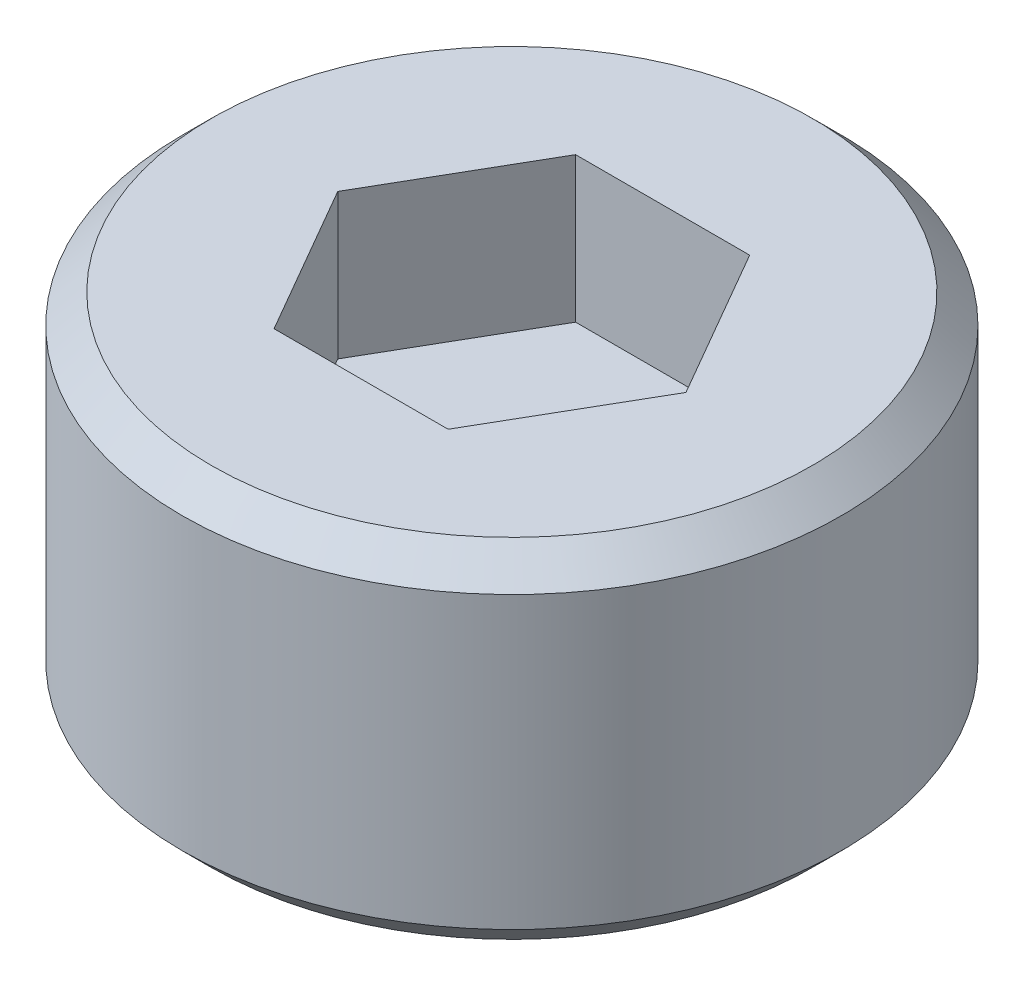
ISO-10303-21;
HEADER;
FILE_DESCRIPTION(('STEP AP214'),'2;1');
FILE_NAME('part.step','',(''),(''),'','','');
FILE_SCHEMA(('AUTOMOTIVE_DESIGN { 1 0 10303 214 1 1 1 1 }'));
ENDSEC;
DATA;
#1=APPLICATION_CONTEXT('core data for automotive mechanical design processes');
#2=APPLICATION_PROTOCOL_DEFINITION('international standard','automotive_design',2000,#1);
#3=PRODUCT_CONTEXT('',#1,'mechanical');
#4=PRODUCT('Part','Part','',(#3));
#5=PRODUCT_RELATED_PRODUCT_CATEGORY('part','',(#4));
#6=PRODUCT_DEFINITION_FORMATION('','',#4);
#7=PRODUCT_DEFINITION_CONTEXT('part definition',#1,'design');
#8=PRODUCT_DEFINITION('design','',#6,#7);
#9=PRODUCT_DEFINITION_SHAPE('','',#8);
#10=(LENGTH_UNIT() NAMED_UNIT(*) SI_UNIT(.MILLI.,.METRE.));
#11=(NAMED_UNIT(*) PLANE_ANGLE_UNIT() SI_UNIT($,.RADIAN.));
#12=(NAMED_UNIT(*) SI_UNIT($,.STERADIAN.) SOLID_ANGLE_UNIT());
#13=UNCERTAINTY_MEASURE_WITH_UNIT(LENGTH_MEASURE(1.E-05),#10,'distance_accuracy_value','');
#14=(GEOMETRIC_REPRESENTATION_CONTEXT(3) GLOBAL_UNCERTAINTY_ASSIGNED_CONTEXT((#13)) GLOBAL_UNIT_ASSIGNED_CONTEXT((#10,
#11,#12)) REPRESENTATION_CONTEXT('',''));
#15=CARTESIAN_POINT('',(0.,0.,0.));
#16=DIRECTION('',(0.,0.,1.));
#17=DIRECTION('',(1.,0.,0.));
#18=AXIS2_PLACEMENT_3D('',#15,#16,#17);
#19=CARTESIAN_POINT('',(0.,1.75,0.));
#20=DIRECTION('',(0.,1.,0.));
#21=DIRECTION('',(1.,0.,0.));
#22=AXIS2_PLACEMENT_3D('',#19,#20,#21);
#23=PLANE('',#22);
#24=DIRECTION('',(-0.500000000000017,0.,-0.866025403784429));
#25=VECTOR('',#24,1.);
#26=CARTESIAN_POINT('',(-0.7499999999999,1.75,1.299038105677));
#27=LINE('',#26,#25);
#28=CARTESIAN_POINT('',(-0.7499999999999,1.75,1.299038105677));
#29=VERTEX_POINT('',#28);
#30=CARTESIAN_POINT('',(-1.5,1.75,0.));
#31=VERTEX_POINT('',#30);
#32=EDGE_CURVE('E167',#29,#31,#27,.T.);
#33=ORIENTED_EDGE('',*,*,#32,.F.);
#34=DIRECTION('',(1.,0.,0.));
#35=VECTOR('',#34,1.);
#36=CARTESIAN_POINT('',(-0.7499999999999,1.75,1.299038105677));
#37=LINE('',#36,#35);
#38=CARTESIAN_POINT('',(0.75,1.75,1.299038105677));
#39=VERTEX_POINT('',#38);
#40=EDGE_CURVE('E11',#29,#39,#37,.T.);
#41=ORIENTED_EDGE('',*,*,#40,.T.);
#42=DIRECTION('',(-0.499999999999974,0.,0.866025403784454));
#43=VECTOR('',#42,1.);
#44=CARTESIAN_POINT('',(1.5,1.75,0.));
#45=LINE('',#44,#43);
#46=CARTESIAN_POINT('',(1.5,1.75,0.));
#47=VERTEX_POINT('',#46);
#48=EDGE_CURVE('E42',#47,#39,#45,.T.);
#49=ORIENTED_EDGE('',*,*,#48,.F.);
#50=DIRECTION('',(0.500000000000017,0.,0.866025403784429));
#51=VECTOR('',#50,1.);
#52=CARTESIAN_POINT('',(0.7499999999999,1.75,-1.299038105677));
#53=LINE('',#52,#51);
#54=CARTESIAN_POINT('',(0.7499999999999,1.75,-1.299038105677));
#55=VERTEX_POINT('',#54);
#56=EDGE_CURVE('E198',#55,#47,#53,.T.);
#57=ORIENTED_EDGE('',*,*,#56,.F.);
#58=DIRECTION('',(-1.,0.,0.));
#59=VECTOR('',#58,1.);
#60=CARTESIAN_POINT('',(0.7499999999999,1.75,-1.299038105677));
#61=LINE('',#60,#59);
#62=CARTESIAN_POINT('',(-0.75,1.75,-1.299038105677));
#63=VERTEX_POINT('',#62);
#64=EDGE_CURVE('E193',#55,#63,#61,.T.);
#65=ORIENTED_EDGE('',*,*,#64,.T.);
#66=DIRECTION('',(0.499999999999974,0.,-0.866025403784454));
#67=VECTOR('',#66,1.);
#68=CARTESIAN_POINT('',(-1.5,1.75,0.));
#69=LINE('',#68,#67);
#70=EDGE_CURVE('E185',#31,#63,#69,.T.);
#71=ORIENTED_EDGE('',*,*,#70,.F.);
#72=EDGE_LOOP('',(#33,#41,#49,#57,#65,#71));
#73=FACE_BOUND('',#72,.T.);
#74=ADVANCED_FACE('F17',(#73),#23,.T.);
#75=CARTESIAN_POINT('',(-0.75,3.,1.299038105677));
#76=DIRECTION('',(0.,0.,1.));
#77=DIRECTION('',(1.,0.,0.));
#78=AXIS2_PLACEMENT_3D('',#75,#76,#77);
#79=PLANE('',#78);
#80=DIRECTION('',(1.,0.,0.));
#81=VECTOR('',#80,1.);
#82=CARTESIAN_POINT('',(-0.7499999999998,3.,1.299038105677));
#83=LINE('',#82,#81);
#84=CARTESIAN_POINT('',(-0.7499999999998,3.,1.299038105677));
#85=VERTEX_POINT('',#84);
#86=CARTESIAN_POINT('',(0.75,3.,1.299038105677));
#87=VERTEX_POINT('',#86);
#88=EDGE_CURVE('E163',#85,#87,#83,.T.);
#89=ORIENTED_EDGE('',*,*,#88,.T.);
#90=DIRECTION('',(0.,-1.,0.));
#91=VECTOR('',#90,1.);
#92=CARTESIAN_POINT('',(0.75,3.,1.299038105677));
#93=LINE('',#92,#91);
#94=EDGE_CURVE('E25',#87,#39,#93,.T.);
#95=ORIENTED_EDGE('',*,*,#94,.T.);
#96=ORIENTED_EDGE('',*,*,#40,.F.);
#97=DIRECTION('',(0.,-1.,0.));
#98=VECTOR('',#97,1.);
#99=CARTESIAN_POINT('',(-0.7499999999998,3.,1.299038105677));
#100=LINE('',#99,#98);
#101=EDGE_CURVE('E172',#85,#29,#100,.T.);
#102=ORIENTED_EDGE('',*,*,#101,.F.);
#103=EDGE_LOOP('',(#89,#95,#96,#102));
#104=FACE_BOUND('',#103,.T.);
#105=ADVANCED_FACE('F213',(#104),#79,.F.);
#106=CARTESIAN_POINT('',(0.75,3.,1.299038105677));
#107=DIRECTION('',(0.866025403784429,0.,0.500000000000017));
#108=DIRECTION('',(0.,-1.,0.));
#109=AXIS2_PLACEMENT_3D('',#106,#107,#108);
#110=PLANE('',#109);
#111=DIRECTION('',(0.499999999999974,0.,-0.866025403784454));
#112=VECTOR('',#111,1.);
#113=CARTESIAN_POINT('',(0.75,3.,1.299038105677));
#114=LINE('',#113,#112);
#115=CARTESIAN_POINT('',(1.5,3.,1.416644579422E-13));
#116=VERTEX_POINT('',#115);
#117=EDGE_CURVE('E145',#87,#116,#114,.T.);
#118=ORIENTED_EDGE('',*,*,#117,.T.);
#119=DIRECTION('',(0.,-1.,0.));
#120=VECTOR('',#119,1.);
#121=CARTESIAN_POINT('',(1.5,3.,1.416526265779E-13));
#122=LINE('',#121,#120);
#123=EDGE_CURVE('E204',#116,#47,#122,.T.);
#124=ORIENTED_EDGE('',*,*,#123,.T.);
#125=ORIENTED_EDGE('',*,*,#48,.T.);
#126=ORIENTED_EDGE('',*,*,#94,.F.);
#127=EDGE_LOOP('',(#118,#124,#125,#126));
#128=FACE_BOUND('',#127,.T.);
#129=ADVANCED_FACE('F217',(#128),#110,.F.);
#130=CARTESIAN_POINT('',(1.5,3.,0.));
#131=DIRECTION('',(0.866025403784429,0.,-0.500000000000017));
#132=DIRECTION('',(0.,-1.,0.));
#133=AXIS2_PLACEMENT_3D('',#130,#131,#132);
#134=PLANE('',#133);
#135=DIRECTION('',(-0.500000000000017,0.,-0.866025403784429));
#136=VECTOR('',#135,1.);
#137=CARTESIAN_POINT('',(1.5,3.,1.416526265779E-13));
#138=LINE('',#137,#136);
#139=CARTESIAN_POINT('',(0.7499999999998,3.,-1.299038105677));
#140=VERTEX_POINT('',#139);
#141=EDGE_CURVE('E141',#116,#140,#138,.T.);
#142=ORIENTED_EDGE('',*,*,#141,.T.);
#143=DIRECTION('',(0.,-1.,0.));
#144=VECTOR('',#143,1.);
#145=CARTESIAN_POINT('',(0.7499999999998,3.,-1.299038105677));
#146=LINE('',#145,#144);
#147=EDGE_CURVE('E194',#140,#55,#146,.T.);
#148=ORIENTED_EDGE('',*,*,#147,.T.);
#149=ORIENTED_EDGE('',*,*,#56,.T.);
#150=ORIENTED_EDGE('',*,*,#123,.F.);
#151=EDGE_LOOP('',(#142,#148,#149,#150));
#152=FACE_BOUND('',#151,.T.);
#153=ADVANCED_FACE('F220',(#152),#134,.F.);
#154=CARTESIAN_POINT('',(0.75,3.,-1.299038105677));
#155=DIRECTION('',(0.,0.,-1.));
#156=DIRECTION('',(0.,-1.,0.));
#157=AXIS2_PLACEMENT_3D('',#154,#155,#156);
#158=PLANE('',#157);
#159=DIRECTION('',(-1.,0.,0.));
#160=VECTOR('',#159,1.);
#161=CARTESIAN_POINT('',(0.7499999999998,3.,-1.299038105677));
#162=LINE('',#161,#160);
#163=CARTESIAN_POINT('',(-0.75,3.,-1.299038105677));
#164=VERTEX_POINT('',#163);
#165=EDGE_CURVE('E146',#140,#164,#162,.T.);
#166=ORIENTED_EDGE('',*,*,#165,.T.);
#167=DIRECTION('',(0.,-1.,0.));
#168=VECTOR('',#167,1.);
#169=CARTESIAN_POINT('',(-0.75,3.,-1.299038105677));
#170=LINE('',#169,#168);
#171=EDGE_CURVE('E189',#164,#63,#170,.T.);
#172=ORIENTED_EDGE('',*,*,#171,.T.);
#173=ORIENTED_EDGE('',*,*,#64,.F.);
#174=ORIENTED_EDGE('',*,*,#147,.F.);
#175=EDGE_LOOP('',(#166,#172,#173,#174));
#176=FACE_BOUND('',#175,.T.);
#177=ADVANCED_FACE('F223',(#176),#158,.F.);
#178=CARTESIAN_POINT('',(-0.75,3.,-1.299038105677));
#179=DIRECTION('',(-0.866025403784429,0.,-0.500000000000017));
#180=DIRECTION('',(-0.500000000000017,0.,0.866025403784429));
#181=AXIS2_PLACEMENT_3D('',#178,#179,#180);
#182=PLANE('',#181);
#183=DIRECTION('',(-0.499999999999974,0.,0.866025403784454));
#184=VECTOR('',#183,1.);
#185=CARTESIAN_POINT('',(-0.75,3.,-1.299038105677));
#186=LINE('',#185,#184);
#187=CARTESIAN_POINT('',(-1.5,3.,-1.416526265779E-13));
#188=VERTEX_POINT('',#187);
#189=EDGE_CURVE('E152',#164,#188,#186,.T.);
#190=ORIENTED_EDGE('',*,*,#189,.T.);
#191=DIRECTION('',(0.,-1.,0.));
#192=VECTOR('',#191,1.);
#193=CARTESIAN_POINT('',(-1.5,3.,-1.416526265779E-13));
#194=LINE('',#193,#192);
#195=EDGE_CURVE('E171',#188,#31,#194,.T.);
#196=ORIENTED_EDGE('',*,*,#195,.T.);
#197=ORIENTED_EDGE('',*,*,#70,.T.);
#198=ORIENTED_EDGE('',*,*,#171,.F.);
#199=EDGE_LOOP('',(#190,#196,#197,#198));
#200=FACE_BOUND('',#199,.T.);
#201=ADVANCED_FACE('F227',(#200),#182,.F.);
#202=CARTESIAN_POINT('',(-1.5,3.,0.));
#203=DIRECTION('',(-0.866025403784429,0.,0.500000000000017));
#204=DIRECTION('',(0.,1.,0.));
#205=AXIS2_PLACEMENT_3D('',#202,#203,#204);
#206=PLANE('',#205);
#207=DIRECTION('',(0.500000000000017,0.,0.866025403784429));
#208=VECTOR('',#207,1.);
#209=CARTESIAN_POINT('',(-1.5,3.,-1.416526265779E-13));
#210=LINE('',#209,#208);
#211=EDGE_CURVE('E149',#188,#85,#210,.T.);
#212=ORIENTED_EDGE('',*,*,#211,.T.);
#213=ORIENTED_EDGE('',*,*,#101,.T.);
#214=ORIENTED_EDGE('',*,*,#32,.T.);
#215=ORIENTED_EDGE('',*,*,#195,.F.);
#216=EDGE_LOOP('',(#212,#213,#214,#215));
#217=FACE_BOUND('',#216,.T.);
#218=ADVANCED_FACE('F230',(#217),#206,.F.);
#219=CARTESIAN_POINT('',(0.,3.,0.));
#220=DIRECTION('',(0.,1.,0.));
#221=DIRECTION('',(1.,0.,0.));
#222=AXIS2_PLACEMENT_3D('',#219,#220,#221);
#223=PLANE('',#222);
#224=ORIENTED_EDGE('',*,*,#211,.F.);
#225=ORIENTED_EDGE('',*,*,#189,.F.);
#226=ORIENTED_EDGE('',*,*,#165,.F.);
#227=ORIENTED_EDGE('',*,*,#141,.F.);
#228=ORIENTED_EDGE('',*,*,#117,.F.);
#229=ORIENTED_EDGE('',*,*,#88,.F.);
#230=EDGE_LOOP('',(#224,#225,#226,#227,#228,#229));
#231=FACE_BOUND('',#230,.T.);
#232=CARTESIAN_POINT('',(0.,3.,0.));
#233=DIRECTION('',(0.,-1.,0.));
#234=DIRECTION('',(1.,0.,0.));
#235=AXIS2_PLACEMENT_3D('',#232,#233,#234);
#236=CIRCLE('',#235,2.59);
#237=CARTESIAN_POINT('',(0.,3.,2.59));
#238=VERTEX_POINT('',#237);
#239=EDGE_CURVE('E147',#238,#238,#236,.T.);
#240=ORIENTED_EDGE('',*,*,#239,.F.);
#241=EDGE_LOOP('',(#240));
#242=FACE_BOUND('',#241,.T.);
#243=ADVANCED_FACE('F232',(#231,#242),#223,.T.);
#244=CARTESIAN_POINT('',(0.,2.875,0.));
#245=DIRECTION('',(0.,-1.,0.));
#246=DIRECTION('',(0.,0.,-1.));
#247=AXIS2_PLACEMENT_3D('',#244,#245,#246);
#248=CONICAL_SURFACE('',#247,2.715,0.785398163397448);
#249=CARTESIAN_POINT('',(0.,2.75,0.));
#250=DIRECTION('',(0.,-1.,0.));
#251=DIRECTION('',(1.,0.,0.));
#252=AXIS2_PLACEMENT_3D('',#249,#250,#251);
#253=CIRCLE('',#252,2.84);
#254=CARTESIAN_POINT('',(0.,2.75,2.84));
#255=VERTEX_POINT('',#254);
#256=CARTESIAN_POINT('',(-2.84,2.75,0.));
#257=VERTEX_POINT('',#256);
#258=EDGE_CURVE('E117',#255,#257,#253,.T.);
#259=ORIENTED_EDGE('',*,*,#258,.F.);
#260=DIRECTION('',(0.,0.707106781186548,-0.707106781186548));
#261=VECTOR('',#260,1.);
#262=CARTESIAN_POINT('',(0.,2.875,2.715));
#263=LINE('',#262,#261);
#264=EDGE_CURVE('E150',#255,#238,#263,.T.);
#265=ORIENTED_EDGE('',*,*,#264,.T.);
#266=ORIENTED_EDGE('',*,*,#239,.T.);
#267=ORIENTED_EDGE('',*,*,#264,.F.);
#268=CARTESIAN_POINT('',(0.,2.75,0.));
#269=DIRECTION('',(0.,-1.,0.));
#270=DIRECTION('',(1.,0.,0.));
#271=AXIS2_PLACEMENT_3D('',#268,#269,#270);
#272=CIRCLE('',#271,2.84);
#273=EDGE_CURVE('E119',#257,#255,#272,.T.);
#274=ORIENTED_EDGE('',*,*,#273,.F.);
#275=EDGE_LOOP('',(#259,#265,#266,#267,#274));
#276=FACE_BOUND('',#275,.T.);
#277=ADVANCED_FACE('F317',(#276),#248,.T.);
#278=CARTESIAN_POINT('',(0.,0.,0.));
#279=DIRECTION('',(0.,1.,0.));
#280=DIRECTION('',(1.,0.,0.));
#281=AXIS2_PLACEMENT_3D('',#278,#279,#280);
#282=CYLINDRICAL_SURFACE('',#281,2.84);
#283=ORIENTED_EDGE('',*,*,#258,.T.);
#284=DIRECTION('',(0.,-1.,0.));
#285=VECTOR('',#284,1.);
#286=CARTESIAN_POINT('',(-2.84,0.,0.));
#287=LINE('',#286,#285);
#288=CARTESIAN_POINT('',(-2.84,0.25,0.));
#289=VERTEX_POINT('',#288);
#290=EDGE_CURVE('E109',#257,#289,#287,.T.);
#291=ORIENTED_EDGE('',*,*,#290,.T.);
#292=CARTESIAN_POINT('',(0.,0.25,0.));
#293=DIRECTION('',(0.,1.,0.));
#294=DIRECTION('',(0.,0.,1.));
#295=AXIS2_PLACEMENT_3D('',#292,#293,#294);
#296=CIRCLE('',#295,2.84);
#297=CARTESIAN_POINT('',(0.,0.25,2.84));
#298=VERTEX_POINT('',#297);
#299=EDGE_CURVE('E113',#289,#298,#296,.T.);
#300=ORIENTED_EDGE('',*,*,#299,.T.);
#301=CARTESIAN_POINT('',(0.,0.25,0.));
#302=DIRECTION('',(0.,1.,0.));
#303=DIRECTION('',(0.,0.,1.));
#304=AXIS2_PLACEMENT_3D('',#301,#302,#303);
#305=CIRCLE('',#304,2.84);
#306=EDGE_CURVE('E124',#298,#289,#305,.T.);
#307=ORIENTED_EDGE('',*,*,#306,.T.);
#308=ORIENTED_EDGE('',*,*,#290,.F.);
#309=ORIENTED_EDGE('',*,*,#273,.T.);
#310=EDGE_LOOP('',(#283,#291,#300,#307,#308,#309));
#311=FACE_BOUND('',#310,.T.);
#312=ADVANCED_FACE('F111',(#311),#282,.T.);
#313=CARTESIAN_POINT('',(0.,0.125,0.));
#314=DIRECTION('',(0.,1.,0.));
#315=DIRECTION('',(0.,0.,-1.));
#316=AXIS2_PLACEMENT_3D('',#313,#314,#315);
#317=CONICAL_SURFACE('',#316,2.715,0.785398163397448);
#318=ORIENTED_EDGE('',*,*,#306,.F.);
#319=DIRECTION('',(0.,-0.707106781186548,-0.707106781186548));
#320=VECTOR('',#319,1.);
#321=CARTESIAN_POINT('',(0.,0.125,2.715));
#322=LINE('',#321,#320);
#323=CARTESIAN_POINT('',(0.,0.,2.59));
#324=VERTEX_POINT('',#323);
#325=EDGE_CURVE('E126',#298,#324,#322,.T.);
#326=ORIENTED_EDGE('',*,*,#325,.T.);
#327=CARTESIAN_POINT('',(0.,0.,0.));
#328=DIRECTION('',(0.,1.,0.));
#329=DIRECTION('',(1.,0.,0.));
#330=AXIS2_PLACEMENT_3D('',#327,#328,#329);
#331=CIRCLE('',#330,2.59);
#332=EDGE_CURVE('E130',#324,#324,#331,.T.);
#333=ORIENTED_EDGE('',*,*,#332,.T.);
#334=ORIENTED_EDGE('',*,*,#325,.F.);
#335=ORIENTED_EDGE('',*,*,#299,.F.);
#336=EDGE_LOOP('',(#318,#326,#333,#334,#335));
#337=FACE_BOUND('',#336,.T.);
#338=ADVANCED_FACE('F123',(#337),#317,.T.);
#339=CARTESIAN_POINT('',(0.,0.,0.));
#340=DIRECTION('',(0.,1.,0.));
#341=DIRECTION('',(1.,0.,0.));
#342=AXIS2_PLACEMENT_3D('',#339,#340,#341);
#343=PLANE('',#342);
#344=ORIENTED_EDGE('',*,*,#332,.F.);
#345=EDGE_LOOP('',(#344));
#346=FACE_BOUND('',#345,.T.);
#347=ADVANCED_FACE('F323',(#346),#343,.F.);
#348=CLOSED_SHELL('',(#74,#105,#129,#153,#177,#201,#218,#243,#277,#312,#338,#347));
#349=MANIFOLD_SOLID_BREP('B1',#348);
#350=ADVANCED_BREP_SHAPE_REPRESENTATION('',(#18,#349),#14);
#351=SHAPE_DEFINITION_REPRESENTATION(#9,#350);
ENDSEC;
END-ISO-10303-21;
